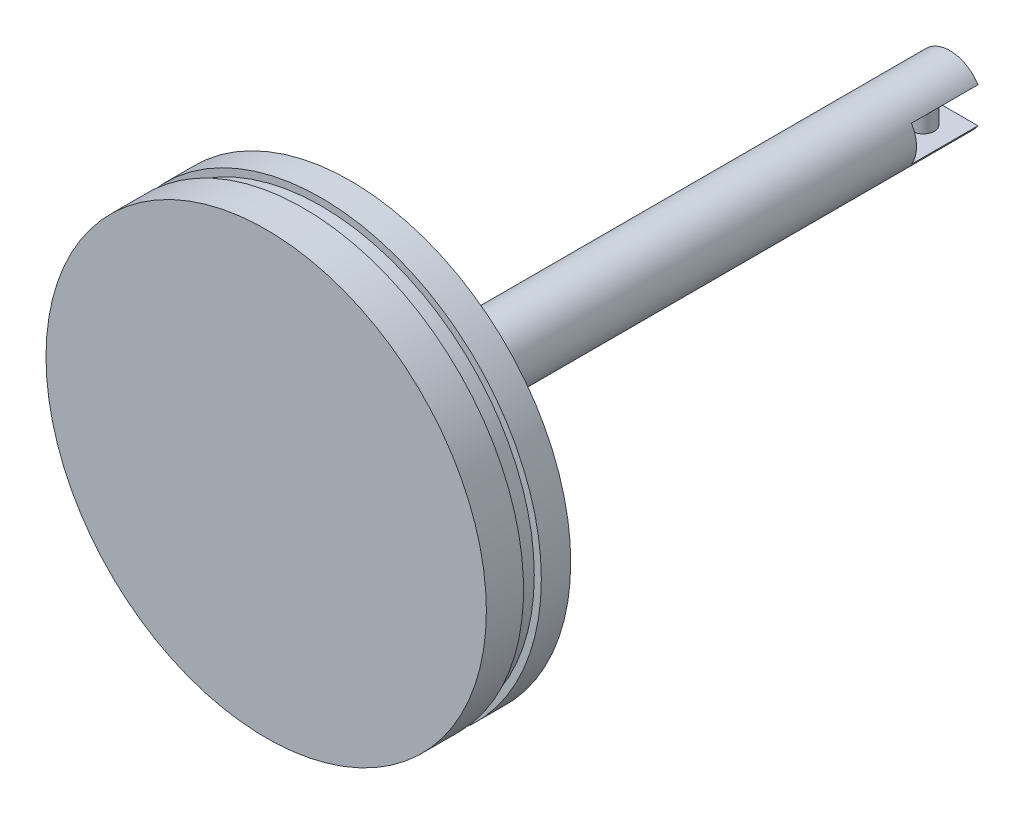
from build123d import *

# Parameters (mm, degrees)
SKETCH1_R           = 49.6
BOSS_EXTRUDE1_DEPTH = 3
SKETCH2_R           = 49.6
SKETCH2_R_2         = 46
BOSS_EXTRUDE2_DEPTH = 15
SKETCH3_R           = 49.6
BOSS_EXTRUDE3_DEPTH = 4
SKETCH4_R           = 2.5
SKETCH4_R_2         = 5
BOSS_EXTRUDE4_DEPTH = 16
SKETCH5_R           = 7.5
BOSS_EXTRUDE5_DEPTH = 135
SKETCH6_W           = 4
SKETCH6_H           = 2.877326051
SKETCH7_W           = 21.216623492
SKETCH7_H           = 8
CUT_EXTRUDE1_DEPTH  = 15
SKETCH8_R           = 2.5
BOSS_EXTRUDE6_DEPTH = 10


with BuildPart() as part:
    # Sketch1 → Boss-Extrude1 (new body)
    with BuildSketch(Plane.XY):
        Circle(SKETCH1_R)
    extrude(amount=BOSS_EXTRUDE1_DEPTH)

    # Sketch2 → Boss-Extrude2 (add)
    with BuildSketch(Plane.XY):
        Circle(SKETCH2_R)
        Circle(SKETCH2_R_2, mode=Mode.SUBTRACT)
    extrude(amount=BOSS_EXTRUDE2_DEPTH)

    # Sketch3 → Boss-Extrude3 (add)
    with BuildSketch(Plane.XY.offset(15)):
        Circle(SKETCH3_R)
    extrude(amount=BOSS_EXTRUDE3_DEPTH)

    # Sketch4 → Boss-Extrude4 (add)
    with BuildSketch(Plane.XY.offset(3)):
        with Locations((-35.987639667, -3.679667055)):
            Circle(SKETCH4_R)
        with Locations((-20.971152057, -26.371770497)):
            Circle(SKETCH4_R)
        with Locations((10.797391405, -30.746904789)):
            Circle(SKETCH4_R)
        with Locations((29.028310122, -5.229746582)):
            Circle(SKETCH4_R)
        with Locations((17.402549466, 21.919229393)):
            Circle(SKETCH4_R)
        with Locations((-12.555375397, 26.332978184)):
            Circle(SKETCH4_R)
        Circle(SKETCH4_R_2)
    extrude(amount=BOSS_EXTRUDE4_DEPTH)

    # Sketch5 → Boss-Extrude5 (add)
    with BuildSketch(Plane.XY):
        Circle(SKETCH5_R)
    extrude(amount=-BOSS_EXTRUDE5_DEPTH)

    # Sketch6 → Cut-Revolve1 (revolve, cut)
    with BuildSketch(Plane(origin=(0, 0, 0), x_dir=(0, 0, -1), z_dir=(1, 0, 0)), mode=Mode.PRIVATE) as cut_revolve1_sk:
        with Locations((-8.620257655, -49.449045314)):
            Rectangle(SKETCH6_W, SKETCH6_H)
    revolve(cut_revolve1_sk.sketch.rotate(Axis((0, 0, 0), (0, 0, 1)), 270), axis=Axis((0, 0, 0), (0, 0, 1)), mode=Mode.SUBTRACT)

    # Sketch7 → Cut-Extrude1 (cut)
    with BuildSketch(Plane(origin=(0, 0, -135), x_dir=(-1, 0, 0), z_dir=(0, 0, -1))):
        Rectangle(SKETCH7_W, SKETCH7_H)
    extrude(amount=-CUT_EXTRUDE1_DEPTH, mode=Mode.SUBTRACT)

    # Sketch8 → Boss-Extrude6 (add)
    with BuildSketch(Plane(origin=(0, -4, 0), x_dir=(1, 0, 0), z_dir=(0, 1, 0))):
        with Locations((0, 129)):
            Circle(SKETCH8_R)
    extrude(amount=BOSS_EXTRUDE6_DEPTH)


solid = part.part
